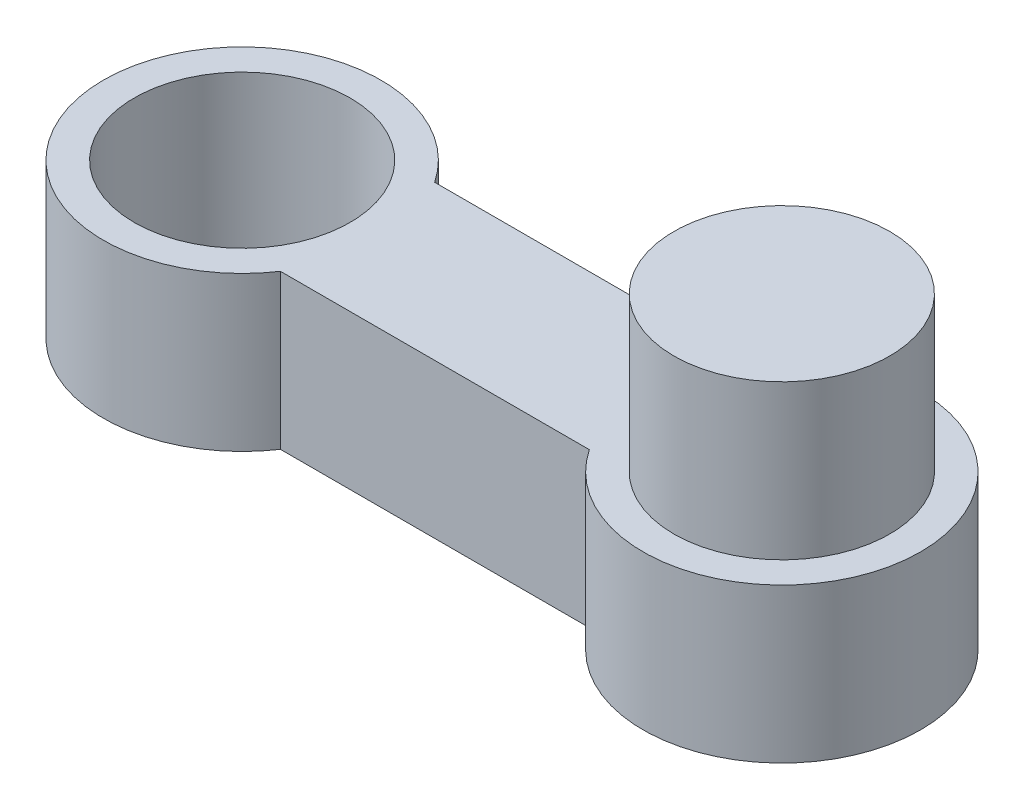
ISO-10303-21;
HEADER;
FILE_DESCRIPTION(('STEP AP214'),'2;1');
FILE_NAME('part.step','',(''),(''),'','','');
FILE_SCHEMA(('AUTOMOTIVE_DESIGN { 1 0 10303 214 1 1 1 1 }'));
ENDSEC;
DATA;
#1=APPLICATION_CONTEXT('core data for automotive mechanical design processes');
#2=APPLICATION_PROTOCOL_DEFINITION('international standard','automotive_design',2000,#1);
#3=PRODUCT_CONTEXT('',#1,'mechanical');
#4=PRODUCT('Part','Part','',(#3));
#5=PRODUCT_RELATED_PRODUCT_CATEGORY('part','',(#4));
#6=PRODUCT_DEFINITION_FORMATION('','',#4);
#7=PRODUCT_DEFINITION_CONTEXT('part definition',#1,'design');
#8=PRODUCT_DEFINITION('design','',#6,#7);
#9=PRODUCT_DEFINITION_SHAPE('','',#8);
#10=(LENGTH_UNIT() NAMED_UNIT(*) SI_UNIT(.MILLI.,.METRE.));
#11=(NAMED_UNIT(*) PLANE_ANGLE_UNIT() SI_UNIT($,.RADIAN.));
#12=(NAMED_UNIT(*) SI_UNIT($,.STERADIAN.) SOLID_ANGLE_UNIT());
#13=UNCERTAINTY_MEASURE_WITH_UNIT(LENGTH_MEASURE(1.E-05),#10,'distance_accuracy_value','');
#14=(GEOMETRIC_REPRESENTATION_CONTEXT(3) GLOBAL_UNCERTAINTY_ASSIGNED_CONTEXT((#13)) GLOBAL_UNIT_ASSIGNED_CONTEXT((#10,
#11,#12)) REPRESENTATION_CONTEXT('',''));
#15=CARTESIAN_POINT('',(0.,0.,0.));
#16=DIRECTION('',(0.,0.,1.));
#17=DIRECTION('',(1.,0.,0.));
#18=AXIS2_PLACEMENT_3D('',#15,#16,#17);
#19=CARTESIAN_POINT('',(-242.625717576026,100.,-175.992438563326));
#20=DIRECTION('',(1.,0.,-1.10744049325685E-13));
#21=DIRECTION('',(-1.10744049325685E-13,0.,-1.));
#22=AXIS2_PLACEMENT_3D('',#19,#20,#21);
#23=PLANE('',#22);
#24=DIRECTION('',(1.10744049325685E-13,0.,1.));
#25=VECTOR('',#24,1.);
#26=CARTESIAN_POINT('',(-242.625717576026,0.,-175.992438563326));
#27=LINE('',#26,#25);
#28=CARTESIAN_POINT('',(-242.625717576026,0.,-176.243066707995));
#29=VERTEX_POINT('',#28);
#30=CARTESIAN_POINT('',(-242.625717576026,0.,-175.992438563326));
#31=VERTEX_POINT('',#30);
#32=EDGE_CURVE('E135',#29,#31,#27,.T.);
#33=ORIENTED_EDGE('',*,*,#32,.T.);
#34=DIRECTION('',(0.,-1.,0.));
#35=VECTOR('',#34,1.);
#36=CARTESIAN_POINT('',(-242.625717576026,100.,-175.992438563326));
#37=LINE('',#36,#35);
#38=CARTESIAN_POINT('',(-242.625717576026,100.,-175.992438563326));
#39=VERTEX_POINT('',#38);
#40=EDGE_CURVE('E11',#39,#31,#37,.T.);
#41=ORIENTED_EDGE('',*,*,#40,.F.);
#42=DIRECTION('',(1.10744049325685E-13,0.,1.));
#43=VECTOR('',#42,1.);
#44=CARTESIAN_POINT('',(-242.625717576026,100.,-175.992438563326));
#45=LINE('',#44,#43);
#46=CARTESIAN_POINT('',(-242.625717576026,100.,-176.243066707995));
#47=VERTEX_POINT('',#46);
#48=EDGE_CURVE('E150',#47,#39,#45,.T.);
#49=ORIENTED_EDGE('',*,*,#48,.F.);
#50=DIRECTION('',(0.,-1.,0.));
#51=VECTOR('',#50,1.);
#52=CARTESIAN_POINT('',(-242.625717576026,100.,-176.243066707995));
#53=LINE('',#52,#51);
#54=EDGE_CURVE('E131',#47,#29,#53,.T.);
#55=ORIENTED_EDGE('',*,*,#54,.T.);
#56=EDGE_LOOP('',(#33,#41,#49,#55));
#57=FACE_BOUND('',#56,.T.);
#58=ADVANCED_FACE('F39',(#57),#23,.F.);
#59=CARTESIAN_POINT('',(-242.625717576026,100.,-175.992438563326));
#60=DIRECTION('',(0.,0.,-1.));
#61=DIRECTION('',(-1.,0.,0.));
#62=AXIS2_PLACEMENT_3D('',#59,#60,#61);
#63=PLANE('',#62);
#64=DIRECTION('',(1.,0.,0.));
#65=VECTOR('',#64,1.);
#66=CARTESIAN_POINT('',(-242.625717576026,0.,-175.992438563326));
#67=LINE('',#66,#65);
#68=CARTESIAN_POINT('',(-42.6257175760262,0.,-175.992438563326));
#69=VERTEX_POINT('',#68);
#70=EDGE_CURVE('E138',#31,#69,#67,.T.);
#71=ORIENTED_EDGE('',*,*,#70,.T.);
#72=DIRECTION('',(0.,-1.,0.));
#73=VECTOR('',#72,1.);
#74=CARTESIAN_POINT('',(-42.6257175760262,100.,-175.992438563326));
#75=LINE('',#74,#73);
#76=CARTESIAN_POINT('',(-42.6257175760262,100.,-175.992438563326));
#77=VERTEX_POINT('',#76);
#78=EDGE_CURVE('E47',#77,#69,#75,.T.);
#79=ORIENTED_EDGE('',*,*,#78,.F.);
#80=DIRECTION('',(1.,0.,0.));
#81=VECTOR('',#80,1.);
#82=CARTESIAN_POINT('',(-242.625717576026,100.,-175.992438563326));
#83=LINE('',#82,#81);
#84=EDGE_CURVE('E98',#39,#77,#83,.T.);
#85=ORIENTED_EDGE('',*,*,#84,.F.);
#86=ORIENTED_EDGE('',*,*,#40,.T.);
#87=EDGE_LOOP('',(#71,#79,#85,#86));
#88=FACE_BOUND('',#87,.T.);
#89=ADVANCED_FACE('F220',(#88),#63,.F.);
#90=CARTESIAN_POINT('',(-42.6257175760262,100.,-175.992438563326));
#91=DIRECTION('',(-1.,0.,0.));
#92=DIRECTION('',(0.,0.,1.));
#93=AXIS2_PLACEMENT_3D('',#90,#91,#92);
#94=PLANE('',#93);
#95=DIRECTION('',(0.,0.,-1.));
#96=VECTOR('',#95,1.);
#97=CARTESIAN_POINT('',(-42.6257175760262,0.,-175.992438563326));
#98=LINE('',#97,#96);
#99=CARTESIAN_POINT('',(-42.6257175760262,0.,-176.243066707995));
#100=VERTEX_POINT('',#99);
#101=EDGE_CURVE('E141',#69,#100,#98,.T.);
#102=ORIENTED_EDGE('',*,*,#101,.T.);
#103=DIRECTION('',(0.,-1.,0.));
#104=VECTOR('',#103,1.);
#105=CARTESIAN_POINT('',(-42.6257175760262,100.,-176.243066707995));
#106=LINE('',#105,#104);
#107=CARTESIAN_POINT('',(-42.6257175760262,100.,-176.243066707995));
#108=VERTEX_POINT('',#107);
#109=EDGE_CURVE('E157',#108,#100,#106,.T.);
#110=ORIENTED_EDGE('',*,*,#109,.F.);
#111=DIRECTION('',(0.,0.,-1.));
#112=VECTOR('',#111,1.);
#113=CARTESIAN_POINT('',(-42.6257175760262,100.,-175.992438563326));
#114=LINE('',#113,#112);
#115=EDGE_CURVE('E165',#77,#108,#114,.T.);
#116=ORIENTED_EDGE('',*,*,#115,.F.);
#117=ORIENTED_EDGE('',*,*,#78,.T.);
#118=EDGE_LOOP('',(#102,#110,#116,#117));
#119=FACE_BOUND('',#118,.T.);
#120=ADVANCED_FACE('F163',(#119),#94,.F.);
#121=CARTESIAN_POINT('',(32.3742824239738,100.,-225.992438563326));
#122=DIRECTION('',(0.,-1.,0.));
#123=DIRECTION('',(0.,0.,-1.));
#124=AXIS2_PLACEMENT_3D('',#121,#122,#123);
#125=CYLINDRICAL_SURFACE('',#124,90.);
#126=CARTESIAN_POINT('',(32.3742824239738,0.,-225.992438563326));
#127=DIRECTION('',(0.,1.,0.));
#128=DIRECTION('',(0.,0.,1.));
#129=AXIS2_PLACEMENT_3D('',#126,#127,#128);
#130=CIRCLE('',#129,90.);
#131=CARTESIAN_POINT('',(-42.6257175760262,0.,-275.741810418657));
#132=VERTEX_POINT('',#131);
#133=EDGE_CURVE('E143',#100,#132,#130,.T.);
#134=ORIENTED_EDGE('',*,*,#133,.T.);
#135=DIRECTION('',(0.,-1.,0.));
#136=VECTOR('',#135,1.);
#137=CARTESIAN_POINT('',(-42.6257175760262,100.,-275.741810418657));
#138=LINE('',#137,#136);
#139=CARTESIAN_POINT('',(-42.6257175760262,100.,-275.741810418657));
#140=VERTEX_POINT('',#139);
#141=EDGE_CURVE('E154',#140,#132,#138,.T.);
#142=ORIENTED_EDGE('',*,*,#141,.F.);
#143=CARTESIAN_POINT('',(32.3742824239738,100.,-225.992438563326));
#144=DIRECTION('',(0.,1.,0.));
#145=DIRECTION('',(0.,0.,1.));
#146=AXIS2_PLACEMENT_3D('',#143,#144,#145);
#147=CIRCLE('',#146,90.);
#148=EDGE_CURVE('E177',#108,#140,#147,.T.);
#149=ORIENTED_EDGE('',*,*,#148,.F.);
#150=ORIENTED_EDGE('',*,*,#109,.T.);
#151=EDGE_LOOP('',(#134,#142,#149,#150));
#152=FACE_BOUND('',#151,.T.);
#153=ADVANCED_FACE('F173',(#152),#125,.T.);
#154=CARTESIAN_POINT('',(-42.6257175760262,100.,-275.741810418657));
#155=DIRECTION('',(-1.,0.,0.));
#156=DIRECTION('',(0.,0.,1.));
#157=AXIS2_PLACEMENT_3D('',#154,#155,#156);
#158=PLANE('',#157);
#159=DIRECTION('',(0.,0.,-1.));
#160=VECTOR('',#159,1.);
#161=CARTESIAN_POINT('',(-42.6257175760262,0.,-275.741810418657));
#162=LINE('',#161,#160);
#163=CARTESIAN_POINT('',(-42.6257175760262,0.,-275.992438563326));
#164=VERTEX_POINT('',#163);
#165=EDGE_CURVE('E145',#132,#164,#162,.T.);
#166=ORIENTED_EDGE('',*,*,#165,.T.);
#167=DIRECTION('',(0.,-1.,0.));
#168=VECTOR('',#167,1.);
#169=CARTESIAN_POINT('',(-42.6257175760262,100.,-275.992438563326));
#170=LINE('',#169,#168);
#171=CARTESIAN_POINT('',(-42.6257175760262,100.,-275.992438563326));
#172=VERTEX_POINT('',#171);
#173=EDGE_CURVE('E126',#172,#164,#170,.T.);
#174=ORIENTED_EDGE('',*,*,#173,.F.);
#175=DIRECTION('',(0.,0.,-1.));
#176=VECTOR('',#175,1.);
#177=CARTESIAN_POINT('',(-42.6257175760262,100.,-275.741810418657));
#178=LINE('',#177,#176);
#179=EDGE_CURVE('E117',#140,#172,#178,.T.);
#180=ORIENTED_EDGE('',*,*,#179,.F.);
#181=ORIENTED_EDGE('',*,*,#141,.T.);
#182=EDGE_LOOP('',(#166,#174,#180,#181));
#183=FACE_BOUND('',#182,.T.);
#184=ADVANCED_FACE('F176',(#183),#158,.F.);
#185=CARTESIAN_POINT('',(-242.625717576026,100.,-275.992438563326));
#186=DIRECTION('',(0.,0.,1.));
#187=DIRECTION('',(1.,0.,0.));
#188=AXIS2_PLACEMENT_3D('',#185,#186,#187);
#189=PLANE('',#188);
#190=DIRECTION('',(-1.,0.,0.));
#191=VECTOR('',#190,1.);
#192=CARTESIAN_POINT('',(-242.625717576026,0.,-275.992438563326));
#193=LINE('',#192,#191);
#194=CARTESIAN_POINT('',(-242.625717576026,0.,-275.992438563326));
#195=VERTEX_POINT('',#194);
#196=EDGE_CURVE('E125',#164,#195,#193,.T.);
#197=ORIENTED_EDGE('',*,*,#196,.T.);
#198=DIRECTION('',(0.,-1.,0.));
#199=VECTOR('',#198,1.);
#200=CARTESIAN_POINT('',(-242.625717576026,100.,-275.992438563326));
#201=LINE('',#200,#199);
#202=CARTESIAN_POINT('',(-242.625717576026,100.,-275.992438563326));
#203=VERTEX_POINT('',#202);
#204=EDGE_CURVE('E122',#203,#195,#201,.T.);
#205=ORIENTED_EDGE('',*,*,#204,.F.);
#206=DIRECTION('',(-1.,0.,0.));
#207=VECTOR('',#206,1.);
#208=CARTESIAN_POINT('',(-242.625717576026,100.,-275.992438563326));
#209=LINE('',#208,#207);
#210=EDGE_CURVE('E111',#172,#203,#209,.T.);
#211=ORIENTED_EDGE('',*,*,#210,.F.);
#212=ORIENTED_EDGE('',*,*,#173,.T.);
#213=EDGE_LOOP('',(#197,#205,#211,#212));
#214=FACE_BOUND('',#213,.T.);
#215=ADVANCED_FACE('F123',(#214),#189,.F.);
#216=CARTESIAN_POINT('',(-242.625717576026,100.,-275.741810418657));
#217=DIRECTION('',(1.,0.,0.));
#218=DIRECTION('',(0.,0.,-1.));
#219=AXIS2_PLACEMENT_3D('',#216,#217,#218);
#220=PLANE('',#219);
#221=DIRECTION('',(0.,0.,1.));
#222=VECTOR('',#221,1.);
#223=CARTESIAN_POINT('',(-242.625717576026,0.,-275.741810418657));
#224=LINE('',#223,#222);
#225=CARTESIAN_POINT('',(-242.625717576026,0.,-275.741810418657));
#226=VERTEX_POINT('',#225);
#227=EDGE_CURVE('E84',#195,#226,#224,.T.);
#228=ORIENTED_EDGE('',*,*,#227,.T.);
#229=DIRECTION('',(0.,-1.,0.));
#230=VECTOR('',#229,1.);
#231=CARTESIAN_POINT('',(-242.625717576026,100.,-275.741810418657));
#232=LINE('',#231,#230);
#233=CARTESIAN_POINT('',(-242.625717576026,100.,-275.741810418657));
#234=VERTEX_POINT('',#233);
#235=EDGE_CURVE('E127',#234,#226,#232,.T.);
#236=ORIENTED_EDGE('',*,*,#235,.F.);
#237=DIRECTION('',(0.,0.,1.));
#238=VECTOR('',#237,1.);
#239=CARTESIAN_POINT('',(-242.625717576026,100.,-275.741810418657));
#240=LINE('',#239,#238);
#241=EDGE_CURVE('E115',#203,#234,#240,.T.);
#242=ORIENTED_EDGE('',*,*,#241,.F.);
#243=ORIENTED_EDGE('',*,*,#204,.T.);
#244=EDGE_LOOP('',(#228,#236,#242,#243));
#245=FACE_BOUND('',#244,.T.);
#246=ADVANCED_FACE('F129',(#245),#220,.F.);
#247=CARTESIAN_POINT('',(-317.625717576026,100.,-225.992438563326));
#248=DIRECTION('',(0.,-1.,0.));
#249=DIRECTION('',(0.,0.,-1.));
#250=AXIS2_PLACEMENT_3D('',#247,#248,#249);
#251=CYLINDRICAL_SURFACE('',#250,90.);
#252=CARTESIAN_POINT('',(-317.625717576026,0.,-225.992438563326));
#253=DIRECTION('',(0.,1.,0.));
#254=DIRECTION('',(0.,0.,1.));
#255=AXIS2_PLACEMENT_3D('',#252,#253,#254);
#256=CIRCLE('',#255,90.);
#257=EDGE_CURVE('E90',#226,#29,#256,.T.);
#258=ORIENTED_EDGE('',*,*,#257,.T.);
#259=ORIENTED_EDGE('',*,*,#54,.F.);
#260=CARTESIAN_POINT('',(-317.625717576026,100.,-225.992438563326));
#261=DIRECTION('',(0.,1.,0.));
#262=DIRECTION('',(0.,0.,1.));
#263=AXIS2_PLACEMENT_3D('',#260,#261,#262);
#264=CIRCLE('',#263,90.);
#265=EDGE_CURVE('E55',#234,#47,#264,.T.);
#266=ORIENTED_EDGE('',*,*,#265,.F.);
#267=ORIENTED_EDGE('',*,*,#235,.T.);
#268=EDGE_LOOP('',(#258,#259,#266,#267));
#269=FACE_BOUND('',#268,.T.);
#270=ADVANCED_FACE('F206',(#269),#251,.T.);
#271=CARTESIAN_POINT('',(-317.625717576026,100.,-225.992438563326));
#272=DIRECTION('',(0.,1.,0.));
#273=DIRECTION('',(0.,0.,1.));
#274=AXIS2_PLACEMENT_3D('',#271,#272,#273);
#275=PLANE('',#274);
#276=CARTESIAN_POINT('',(32.3742824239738,100.,-225.992438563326));
#277=DIRECTION('',(0.,1.,0.));
#278=DIRECTION('',(0.,0.,1.));
#279=AXIS2_PLACEMENT_3D('',#276,#277,#278);
#280=CIRCLE('',#279,70.0000000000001);
#281=CARTESIAN_POINT('',(32.3742824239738,100.,-155.992438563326));
#282=VERTEX_POINT('',#281);
#283=EDGE_CURVE('E189',#282,#282,#280,.T.);
#284=ORIENTED_EDGE('',*,*,#283,.F.);
#285=EDGE_LOOP('',(#284));
#286=FACE_BOUND('',#285,.T.);
#287=CARTESIAN_POINT('',(-317.625717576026,100.,-225.992438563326));
#288=DIRECTION('',(0.,1.,0.));
#289=DIRECTION('',(0.,0.,1.));
#290=AXIS2_PLACEMENT_3D('',#287,#288,#289);
#291=CIRCLE('',#290,70.);
#292=CARTESIAN_POINT('',(-317.625717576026,100.,-155.992438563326));
#293=VERTEX_POINT('',#292);
#294=EDGE_CURVE('E183',#293,#293,#291,.T.);
#295=ORIENTED_EDGE('',*,*,#294,.F.);
#296=EDGE_LOOP('',(#295));
#297=FACE_BOUND('',#296,.T.);
#298=ORIENTED_EDGE('',*,*,#48,.T.);
#299=ORIENTED_EDGE('',*,*,#84,.T.);
#300=ORIENTED_EDGE('',*,*,#115,.T.);
#301=ORIENTED_EDGE('',*,*,#148,.T.);
#302=ORIENTED_EDGE('',*,*,#179,.T.);
#303=ORIENTED_EDGE('',*,*,#210,.T.);
#304=ORIENTED_EDGE('',*,*,#241,.T.);
#305=ORIENTED_EDGE('',*,*,#265,.T.);
#306=EDGE_LOOP('',(#298,#299,#300,#301,#302,#303,#304,#305));
#307=FACE_BOUND('',#306,.T.);
#308=ADVANCED_FACE('F113',(#286,#297,#307),#275,.T.);
#309=CARTESIAN_POINT('',(-317.625717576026,0.,-225.992438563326));
#310=DIRECTION('',(0.,1.,0.));
#311=DIRECTION('',(0.,0.,1.));
#312=AXIS2_PLACEMENT_3D('',#309,#310,#311);
#313=PLANE('',#312);
#314=CARTESIAN_POINT('',(-317.625717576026,0.,-225.992438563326));
#315=DIRECTION('',(0.,1.,0.));
#316=DIRECTION('',(0.,0.,1.));
#317=AXIS2_PLACEMENT_3D('',#314,#315,#316);
#318=CIRCLE('',#317,70.);
#319=CARTESIAN_POINT('',(-317.625717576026,0.,-155.992438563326));
#320=VERTEX_POINT('',#319);
#321=EDGE_CURVE('E139',#320,#320,#318,.T.);
#322=ORIENTED_EDGE('',*,*,#321,.T.);
#323=EDGE_LOOP('',(#322));
#324=FACE_BOUND('',#323,.T.);
#325=ORIENTED_EDGE('',*,*,#32,.F.);
#326=ORIENTED_EDGE('',*,*,#257,.F.);
#327=ORIENTED_EDGE('',*,*,#227,.F.);
#328=ORIENTED_EDGE('',*,*,#196,.F.);
#329=ORIENTED_EDGE('',*,*,#165,.F.);
#330=ORIENTED_EDGE('',*,*,#133,.F.);
#331=ORIENTED_EDGE('',*,*,#101,.F.);
#332=ORIENTED_EDGE('',*,*,#70,.F.);
#333=EDGE_LOOP('',(#325,#326,#327,#328,#329,#330,#331,#332));
#334=FACE_BOUND('',#333,.T.);
#335=ADVANCED_FACE('F169',(#324,#334),#313,.F.);
#336=CARTESIAN_POINT('',(-317.625717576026,0.,-225.992438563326));
#337=DIRECTION('',(0.,1.,0.));
#338=DIRECTION('',(0.,0.,1.));
#339=AXIS2_PLACEMENT_3D('',#336,#337,#338);
#340=CYLINDRICAL_SURFACE('',#339,70.);
#341=ORIENTED_EDGE('',*,*,#321,.F.);
#342=EDGE_LOOP('',(#341));
#343=FACE_BOUND('',#342,.T.);
#344=ORIENTED_EDGE('',*,*,#294,.T.);
#345=EDGE_LOOP('',(#344));
#346=FACE_BOUND('',#345,.T.);
#347=ADVANCED_FACE('F200',(#343,#346),#340,.F.);
#348=CARTESIAN_POINT('',(32.3742824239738,200.,-225.992438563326));
#349=DIRECTION('',(0.,-1.,0.));
#350=DIRECTION('',(0.,0.,-1.));
#351=AXIS2_PLACEMENT_3D('',#348,#349,#350);
#352=CYLINDRICAL_SURFACE('',#351,70.0000000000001);
#353=CARTESIAN_POINT('',(32.3742824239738,200.,-225.992438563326));
#354=DIRECTION('',(0.,1.,0.));
#355=DIRECTION('',(0.,0.,1.));
#356=AXIS2_PLACEMENT_3D('',#353,#354,#355);
#357=CIRCLE('',#356,70.0000000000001);
#358=CARTESIAN_POINT('',(32.3742824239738,200.,-155.992438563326));
#359=VERTEX_POINT('',#358);
#360=EDGE_CURVE('E186',#359,#359,#357,.T.);
#361=ORIENTED_EDGE('',*,*,#360,.F.);
#362=EDGE_LOOP('',(#361));
#363=FACE_BOUND('',#362,.T.);
#364=ORIENTED_EDGE('',*,*,#283,.T.);
#365=EDGE_LOOP('',(#364));
#366=FACE_BOUND('',#365,.T.);
#367=ADVANCED_FACE('F197',(#363,#366),#352,.T.);
#368=CARTESIAN_POINT('',(32.3742824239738,200.,-225.992438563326));
#369=DIRECTION('',(0.,1.,0.));
#370=DIRECTION('',(0.,0.,1.));
#371=AXIS2_PLACEMENT_3D('',#368,#369,#370);
#372=PLANE('',#371);
#373=ORIENTED_EDGE('',*,*,#360,.T.);
#374=EDGE_LOOP('',(#373));
#375=FACE_BOUND('',#374,.T.);
#376=ADVANCED_FACE('F195',(#375),#372,.T.);
#377=CLOSED_SHELL('',(#58,#89,#120,#153,#184,#215,#246,#270,#308,#335,#347,#367,#376));
#378=MANIFOLD_SOLID_BREP('B2',#377);
#379=ADVANCED_BREP_SHAPE_REPRESENTATION('',(#18,#378),#14);
#380=SHAPE_DEFINITION_REPRESENTATION(#9,#379);
ENDSEC;
END-ISO-10303-21;
